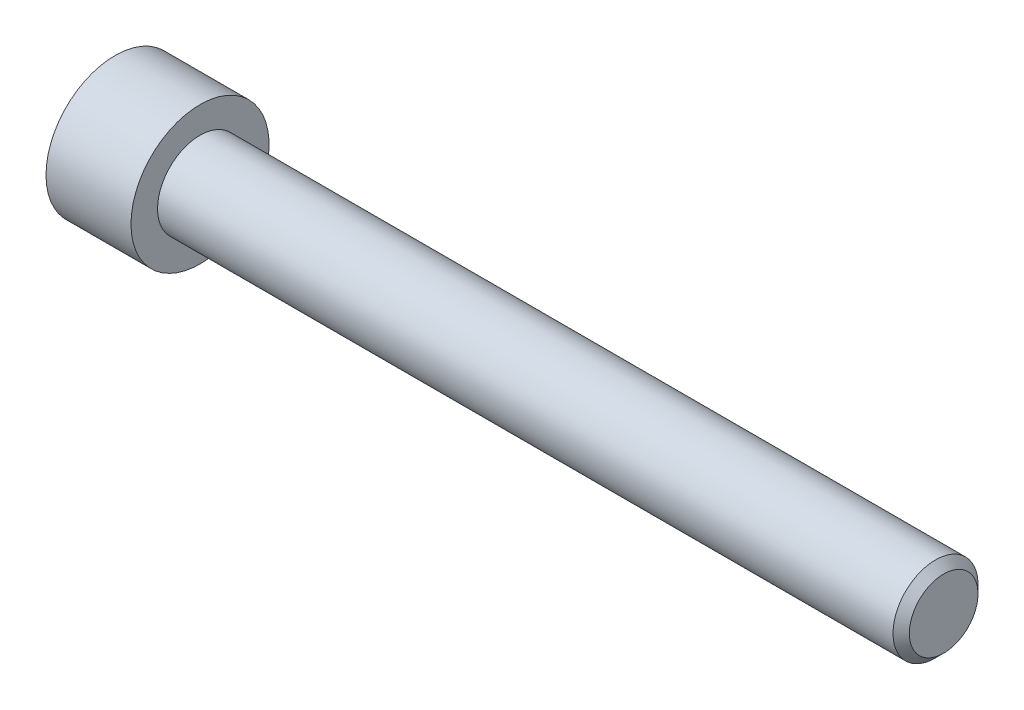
ISO-10303-21;
HEADER;
FILE_DESCRIPTION(('STEP AP214'),'2;1');
FILE_NAME('part.step','',(''),(''),'','','');
FILE_SCHEMA(('AUTOMOTIVE_DESIGN { 1 0 10303 214 1 1 1 1 }'));
ENDSEC;
DATA;
#1=APPLICATION_CONTEXT('core data for automotive mechanical design processes');
#2=APPLICATION_PROTOCOL_DEFINITION('international standard','automotive_design',2000,#1);
#3=PRODUCT_CONTEXT('',#1,'mechanical');
#4=PRODUCT('Part','Part','',(#3));
#5=PRODUCT_RELATED_PRODUCT_CATEGORY('part','',(#4));
#6=PRODUCT_DEFINITION_FORMATION('','',#4);
#7=PRODUCT_DEFINITION_CONTEXT('part definition',#1,'design');
#8=PRODUCT_DEFINITION('design','',#6,#7);
#9=PRODUCT_DEFINITION_SHAPE('','',#8);
#10=(LENGTH_UNIT() NAMED_UNIT(*) SI_UNIT(.MILLI.,.METRE.));
#11=(NAMED_UNIT(*) PLANE_ANGLE_UNIT() SI_UNIT($,.RADIAN.));
#12=(NAMED_UNIT(*) SI_UNIT($,.STERADIAN.) SOLID_ANGLE_UNIT());
#13=UNCERTAINTY_MEASURE_WITH_UNIT(LENGTH_MEASURE(1.E-05),#10,'distance_accuracy_value','');
#14=(GEOMETRIC_REPRESENTATION_CONTEXT(3) GLOBAL_UNCERTAINTY_ASSIGNED_CONTEXT((#13)) GLOBAL_UNIT_ASSIGNED_CONTEXT((#10,
#11,#12)) REPRESENTATION_CONTEXT('',''));
#15=CARTESIAN_POINT('',(0.,0.,0.));
#16=DIRECTION('',(0.,0.,1.));
#17=DIRECTION('',(1.,0.,0.));
#18=AXIS2_PLACEMENT_3D('',#15,#16,#17);
#19=CARTESIAN_POINT('',(-4.,1.73205080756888,3.));
#20=DIRECTION('',(1.,0.,0.));
#21=DIRECTION('',(0.,0.,-1.));
#22=AXIS2_PLACEMENT_3D('',#19,#20,#21);
#23=PLANE('',#22);
#24=DIRECTION('',(0.,-0.5,0.866025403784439));
#25=VECTOR('',#24,1.);
#26=CARTESIAN_POINT('',(-4.,3.46410161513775,0.));
#27=LINE('',#26,#25);
#28=CARTESIAN_POINT('',(-4.,3.46410161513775,0.));
#29=VERTEX_POINT('',#28);
#30=CARTESIAN_POINT('',(-4.,1.73205080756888,3.));
#31=VERTEX_POINT('',#30);
#32=EDGE_CURVE('E182',#29,#31,#27,.T.);
#33=ORIENTED_EDGE('',*,*,#32,.F.);
#34=DIRECTION('',(0.,0.5,0.866025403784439));
#35=VECTOR('',#34,1.);
#36=CARTESIAN_POINT('',(-4.,1.73205080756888,-3.));
#37=LINE('',#36,#35);
#38=CARTESIAN_POINT('',(-4.,1.73205080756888,-3.));
#39=VERTEX_POINT('',#38);
#40=EDGE_CURVE('E54',#39,#29,#37,.T.);
#41=ORIENTED_EDGE('',*,*,#40,.F.);
#42=DIRECTION('',(0.,1.,0.));
#43=VECTOR('',#42,1.);
#44=CARTESIAN_POINT('',(-4.,-1.73205080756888,-3.));
#45=LINE('',#44,#43);
#46=CARTESIAN_POINT('',(-4.,-1.73205080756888,-3.));
#47=VERTEX_POINT('',#46);
#48=EDGE_CURVE('E174',#47,#39,#45,.T.);
#49=ORIENTED_EDGE('',*,*,#48,.F.);
#50=DIRECTION('',(0.,0.5,-0.866025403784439));
#51=VECTOR('',#50,1.);
#52=CARTESIAN_POINT('',(-4.,-3.46410161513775,0.));
#53=LINE('',#52,#51);
#54=CARTESIAN_POINT('',(-4.,-3.46410161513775,0.));
#55=VERTEX_POINT('',#54);
#56=EDGE_CURVE('E176',#55,#47,#53,.T.);
#57=ORIENTED_EDGE('',*,*,#56,.F.);
#58=DIRECTION('',(0.,-0.5,-0.866025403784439));
#59=VECTOR('',#58,1.);
#60=CARTESIAN_POINT('',(-4.,-1.73205080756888,3.));
#61=LINE('',#60,#59);
#62=CARTESIAN_POINT('',(-4.,-1.73205080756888,3.));
#63=VERTEX_POINT('',#62);
#64=EDGE_CURVE('E178',#63,#55,#61,.T.);
#65=ORIENTED_EDGE('',*,*,#64,.F.);
#66=DIRECTION('',(0.,-1.,0.));
#67=VECTOR('',#66,1.);
#68=CARTESIAN_POINT('',(-4.,1.73205080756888,3.));
#69=LINE('',#68,#67);
#70=EDGE_CURVE('E180',#31,#63,#69,.T.);
#71=ORIENTED_EDGE('',*,*,#70,.F.);
#72=EDGE_LOOP('',(#33,#41,#49,#57,#65,#71));
#73=FACE_BOUND('',#72,.T.);
#74=CARTESIAN_POINT('',(-4.,0.,0.));
#75=DIRECTION('',(-1.,0.,0.));
#76=DIRECTION('',(0.,0.,1.));
#77=AXIS2_PLACEMENT_3D('',#74,#75,#76);
#78=CIRCLE('',#77,2.99);
#79=CARTESIAN_POINT('',(-4.,0.,2.99));
#80=VERTEX_POINT('',#79);
#81=EDGE_CURVE('E201',#80,#80,#78,.T.);
#82=ORIENTED_EDGE('',*,*,#81,.F.);
#83=EDGE_LOOP('',(#82));
#84=FACE_BOUND('',#83,.T.);
#85=ADVANCED_FACE('F32',(#73,#84),#23,.F.);
#86=CARTESIAN_POINT('',(-8.,0.,0.));
#87=DIRECTION('',(1.,0.,0.));
#88=DIRECTION('',(0.,0.,-1.));
#89=AXIS2_PLACEMENT_3D('',#86,#87,#88);
#90=PLANE('',#89);
#91=CARTESIAN_POINT('',(-8.00000000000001,0.,0.));
#92=DIRECTION('',(-1.,0.,0.));
#93=DIRECTION('',(0.,0.,1.));
#94=AXIS2_PLACEMENT_3D('',#91,#92,#93);
#95=CIRCLE('',#94,6.5);
#96=CARTESIAN_POINT('',(-8.00000000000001,0.,6.5));
#97=VERTEX_POINT('',#96);
#98=EDGE_CURVE('E11',#97,#97,#95,.T.);
#99=ORIENTED_EDGE('',*,*,#98,.T.);
#100=EDGE_LOOP('',(#99));
#101=FACE_BOUND('',#100,.T.);
#102=DIRECTION('',(0.,-0.5,0.866025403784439));
#103=VECTOR('',#102,1.);
#104=CARTESIAN_POINT('',(-8.,3.46410161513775,0.));
#105=LINE('',#104,#103);
#106=CARTESIAN_POINT('',(-8.,3.46410161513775,0.));
#107=VERTEX_POINT('',#106);
#108=CARTESIAN_POINT('',(-8.,1.73205080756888,3.));
#109=VERTEX_POINT('',#108);
#110=EDGE_CURVE('E47',#107,#109,#105,.T.);
#111=ORIENTED_EDGE('',*,*,#110,.T.);
#112=DIRECTION('',(0.,-1.,0.));
#113=VECTOR('',#112,1.);
#114=CARTESIAN_POINT('',(-8.,1.73205080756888,3.));
#115=LINE('',#114,#113);
#116=CARTESIAN_POINT('',(-8.,-1.73205080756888,3.));
#117=VERTEX_POINT('',#116);
#118=EDGE_CURVE('E197',#109,#117,#115,.T.);
#119=ORIENTED_EDGE('',*,*,#118,.T.);
#120=DIRECTION('',(0.,-0.5,-0.866025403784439));
#121=VECTOR('',#120,1.);
#122=CARTESIAN_POINT('',(-8.,-1.73205080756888,3.));
#123=LINE('',#122,#121);
#124=CARTESIAN_POINT('',(-8.,-3.46410161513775,0.));
#125=VERTEX_POINT('',#124);
#126=EDGE_CURVE('E194',#117,#125,#123,.T.);
#127=ORIENTED_EDGE('',*,*,#126,.T.);
#128=DIRECTION('',(0.,0.5,-0.866025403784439));
#129=VECTOR('',#128,1.);
#130=CARTESIAN_POINT('',(-8.,-3.46410161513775,0.));
#131=LINE('',#130,#129);
#132=CARTESIAN_POINT('',(-8.,-1.73205080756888,-3.));
#133=VERTEX_POINT('',#132);
#134=EDGE_CURVE('E191',#125,#133,#131,.T.);
#135=ORIENTED_EDGE('',*,*,#134,.T.);
#136=DIRECTION('',(0.,1.,0.));
#137=VECTOR('',#136,1.);
#138=CARTESIAN_POINT('',(-8.,-1.73205080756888,-3.));
#139=LINE('',#138,#137);
#140=CARTESIAN_POINT('',(-8.,1.73205080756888,-3.));
#141=VERTEX_POINT('',#140);
#142=EDGE_CURVE('E188',#133,#141,#139,.T.);
#143=ORIENTED_EDGE('',*,*,#142,.T.);
#144=DIRECTION('',(0.,0.5,0.866025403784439));
#145=VECTOR('',#144,1.);
#146=CARTESIAN_POINT('',(-8.,1.73205080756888,-3.));
#147=LINE('',#146,#145);
#148=EDGE_CURVE('E185',#141,#107,#147,.T.);
#149=ORIENTED_EDGE('',*,*,#148,.T.);
#150=EDGE_LOOP('',(#111,#119,#127,#135,#143,#149));
#151=FACE_BOUND('',#150,.T.);
#152=ADVANCED_FACE('F34',(#101,#151),#90,.F.);
#153=CARTESIAN_POINT('',(70.,0.,0.));
#154=DIRECTION('',(-1.,0.,0.));
#155=DIRECTION('',(0.,0.,1.));
#156=AXIS2_PLACEMENT_3D('',#153,#154,#155);
#157=CYLINDRICAL_SURFACE('',#156,6.5);
#158=ORIENTED_EDGE('',*,*,#98,.F.);
#159=EDGE_LOOP('',(#158));
#160=FACE_BOUND('',#159,.T.);
#161=CARTESIAN_POINT('',(0.,0.,0.));
#162=DIRECTION('',(-1.,0.,0.));
#163=DIRECTION('',(0.,0.,1.));
#164=AXIS2_PLACEMENT_3D('',#161,#162,#163);
#165=CIRCLE('',#164,6.5);
#166=CARTESIAN_POINT('',(0.,0.,6.5));
#167=VERTEX_POINT('',#166);
#168=EDGE_CURVE('E40',#167,#167,#165,.T.);
#169=ORIENTED_EDGE('',*,*,#168,.T.);
#170=EDGE_LOOP('',(#169));
#171=FACE_BOUND('',#170,.T.);
#172=ADVANCED_FACE('F105',(#160,#171),#157,.T.);
#173=CARTESIAN_POINT('',(0.,6.5,0.));
#174=DIRECTION('',(-1.,0.,0.));
#175=DIRECTION('',(0.,0.,1.));
#176=AXIS2_PLACEMENT_3D('',#173,#174,#175);
#177=PLANE('',#176);
#178=ORIENTED_EDGE('',*,*,#168,.F.);
#179=EDGE_LOOP('',(#178));
#180=FACE_BOUND('',#179,.T.);
#181=CARTESIAN_POINT('',(0.,0.,0.));
#182=DIRECTION('',(-1.,0.,0.));
#183=DIRECTION('',(0.,0.,1.));
#184=AXIS2_PLACEMENT_3D('',#181,#182,#183);
#185=CIRCLE('',#184,4.);
#186=CARTESIAN_POINT('',(0.,0.,4.));
#187=VERTEX_POINT('',#186);
#188=EDGE_CURVE('E151',#187,#187,#185,.T.);
#189=ORIENTED_EDGE('',*,*,#188,.T.);
#190=EDGE_LOOP('',(#189));
#191=FACE_BOUND('',#190,.T.);
#192=ADVANCED_FACE('F139',(#180,#191),#177,.F.);
#193=CARTESIAN_POINT('',(70.,0.,0.));
#194=DIRECTION('',(-1.,0.,0.));
#195=DIRECTION('',(0.,0.,1.));
#196=AXIS2_PLACEMENT_3D('',#193,#194,#195);
#197=CYLINDRICAL_SURFACE('',#196,4.);
#198=ORIENTED_EDGE('',*,*,#188,.F.);
#199=EDGE_LOOP('',(#198));
#200=FACE_BOUND('',#199,.T.);
#201=CARTESIAN_POINT('',(69.233,0.,0.));
#202=DIRECTION('',(-1.,0.,0.));
#203=DIRECTION('',(0.,0.,1.));
#204=AXIS2_PLACEMENT_3D('',#201,#202,#203);
#205=CIRCLE('',#204,4.);
#206=CARTESIAN_POINT('',(69.233,0.,4.));
#207=VERTEX_POINT('',#206);
#208=EDGE_CURVE('E153',#207,#207,#205,.T.);
#209=ORIENTED_EDGE('',*,*,#208,.T.);
#210=EDGE_LOOP('',(#209));
#211=FACE_BOUND('',#210,.T.);
#212=ADVANCED_FACE('F135',(#200,#211),#197,.T.);
#213=CARTESIAN_POINT('',(70.,0.,0.));
#214=DIRECTION('',(-1.,0.,0.));
#215=DIRECTION('',(0.,0.,1.));
#216=AXIS2_PLACEMENT_3D('',#213,#214,#215);
#217=CONICAL_SURFACE('',#216,3.233,0.785398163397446);
#218=ORIENTED_EDGE('',*,*,#208,.F.);
#219=EDGE_LOOP('',(#218));
#220=FACE_BOUND('',#219,.T.);
#221=CARTESIAN_POINT('',(70.,0.,0.));
#222=DIRECTION('',(-1.,0.,0.));
#223=DIRECTION('',(0.,0.,1.));
#224=AXIS2_PLACEMENT_3D('',#221,#222,#223);
#225=CIRCLE('',#224,3.233);
#226=CARTESIAN_POINT('',(70.,0.,3.233));
#227=VERTEX_POINT('',#226);
#228=EDGE_CURVE('E158',#227,#227,#225,.T.);
#229=ORIENTED_EDGE('',*,*,#228,.T.);
#230=EDGE_LOOP('',(#229));
#231=FACE_BOUND('',#230,.T.);
#232=ADVANCED_FACE('F131',(#220,#231),#217,.T.);
#233=CARTESIAN_POINT('',(70.,3.233,0.));
#234=DIRECTION('',(-1.,0.,0.));
#235=DIRECTION('',(0.,0.,1.));
#236=AXIS2_PLACEMENT_3D('',#233,#234,#235);
#237=PLANE('',#236);
#238=ORIENTED_EDGE('',*,*,#228,.F.);
#239=EDGE_LOOP('',(#238));
#240=FACE_BOUND('',#239,.T.);
#241=ADVANCED_FACE('F128',(#240),#237,.F.);
#242=CARTESIAN_POINT('',(-4.,3.46410161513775,0.));
#243=DIRECTION('',(0.,-0.866025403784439,-0.5));
#244=DIRECTION('',(0.,0.5,-0.866025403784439));
#245=AXIS2_PLACEMENT_3D('',#242,#243,#244);
#246=PLANE('',#245);
#247=ORIENTED_EDGE('',*,*,#110,.F.);
#248=DIRECTION('',(-1.,0.,0.));
#249=VECTOR('',#248,1.);
#250=CARTESIAN_POINT('',(-4.,3.46410161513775,0.));
#251=LINE('',#250,#249);
#252=EDGE_CURVE('E171',#29,#107,#251,.T.);
#253=ORIENTED_EDGE('',*,*,#252,.F.);
#254=ORIENTED_EDGE('',*,*,#32,.T.);
#255=DIRECTION('',(-1.,0.,0.));
#256=VECTOR('',#255,1.);
#257=CARTESIAN_POINT('',(-4.,1.73205080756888,3.));
#258=LINE('',#257,#256);
#259=EDGE_CURVE('E161',#31,#109,#258,.T.);
#260=ORIENTED_EDGE('',*,*,#259,.T.);
#261=EDGE_LOOP('',(#247,#253,#254,#260));
#262=FACE_BOUND('',#261,.T.);
#263=ADVANCED_FACE('F124',(#262),#246,.T.);
#264=CARTESIAN_POINT('',(-4.,1.73205080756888,3.));
#265=DIRECTION('',(0.,0.,-1.));
#266=DIRECTION('',(-1.,0.,0.));
#267=AXIS2_PLACEMENT_3D('',#264,#265,#266);
#268=PLANE('',#267);
#269=ORIENTED_EDGE('',*,*,#118,.F.);
#270=ORIENTED_EDGE('',*,*,#259,.F.);
#271=ORIENTED_EDGE('',*,*,#70,.T.);
#272=DIRECTION('',(-1.,0.,0.));
#273=VECTOR('',#272,1.);
#274=CARTESIAN_POINT('',(-4.,-1.73205080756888,3.));
#275=LINE('',#274,#273);
#276=EDGE_CURVE('E163',#63,#117,#275,.T.);
#277=ORIENTED_EDGE('',*,*,#276,.T.);
#278=EDGE_LOOP('',(#269,#270,#271,#277));
#279=FACE_BOUND('',#278,.T.);
#280=ADVANCED_FACE('F120',(#279),#268,.T.);
#281=CARTESIAN_POINT('',(-4.,-1.73205080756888,3.));
#282=DIRECTION('',(0.,0.866025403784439,-0.5));
#283=DIRECTION('',(0.,0.5,0.866025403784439));
#284=AXIS2_PLACEMENT_3D('',#281,#282,#283);
#285=PLANE('',#284);
#286=ORIENTED_EDGE('',*,*,#126,.F.);
#287=ORIENTED_EDGE('',*,*,#276,.F.);
#288=ORIENTED_EDGE('',*,*,#64,.T.);
#289=DIRECTION('',(-1.,0.,0.));
#290=VECTOR('',#289,1.);
#291=CARTESIAN_POINT('',(-4.,-3.46410161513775,0.));
#292=LINE('',#291,#290);
#293=EDGE_CURVE('E165',#55,#125,#292,.T.);
#294=ORIENTED_EDGE('',*,*,#293,.T.);
#295=EDGE_LOOP('',(#286,#287,#288,#294));
#296=FACE_BOUND('',#295,.T.);
#297=ADVANCED_FACE('F116',(#296),#285,.T.);
#298=CARTESIAN_POINT('',(-4.,-3.46410161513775,0.));
#299=DIRECTION('',(0.,0.866025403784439,0.5));
#300=DIRECTION('',(0.,-0.5,0.866025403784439));
#301=AXIS2_PLACEMENT_3D('',#298,#299,#300);
#302=PLANE('',#301);
#303=ORIENTED_EDGE('',*,*,#134,.F.);
#304=ORIENTED_EDGE('',*,*,#293,.F.);
#305=ORIENTED_EDGE('',*,*,#56,.T.);
#306=DIRECTION('',(-1.,0.,0.));
#307=VECTOR('',#306,1.);
#308=CARTESIAN_POINT('',(-4.,-1.73205080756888,-3.));
#309=LINE('',#308,#307);
#310=EDGE_CURVE('E167',#47,#133,#309,.T.);
#311=ORIENTED_EDGE('',*,*,#310,.T.);
#312=EDGE_LOOP('',(#303,#304,#305,#311));
#313=FACE_BOUND('',#312,.T.);
#314=ADVANCED_FACE('F112',(#313),#302,.T.);
#315=CARTESIAN_POINT('',(-4.,-1.73205080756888,-3.));
#316=DIRECTION('',(0.,0.,1.));
#317=DIRECTION('',(1.,0.,0.));
#318=AXIS2_PLACEMENT_3D('',#315,#316,#317);
#319=PLANE('',#318);
#320=ORIENTED_EDGE('',*,*,#142,.F.);
#321=ORIENTED_EDGE('',*,*,#310,.F.);
#322=ORIENTED_EDGE('',*,*,#48,.T.);
#323=DIRECTION('',(-1.,0.,0.));
#324=VECTOR('',#323,1.);
#325=CARTESIAN_POINT('',(-4.,1.73205080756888,-3.));
#326=LINE('',#325,#324);
#327=EDGE_CURVE('E169',#39,#141,#326,.T.);
#328=ORIENTED_EDGE('',*,*,#327,.T.);
#329=EDGE_LOOP('',(#320,#321,#322,#328));
#330=FACE_BOUND('',#329,.T.);
#331=ADVANCED_FACE('F96',(#330),#319,.T.);
#332=CARTESIAN_POINT('',(-4.,1.73205080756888,-3.));
#333=DIRECTION('',(0.,-0.866025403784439,0.5));
#334=DIRECTION('',(0.,-0.5,-0.866025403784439));
#335=AXIS2_PLACEMENT_3D('',#332,#333,#334);
#336=PLANE('',#335);
#337=ORIENTED_EDGE('',*,*,#148,.F.);
#338=ORIENTED_EDGE('',*,*,#327,.F.);
#339=ORIENTED_EDGE('',*,*,#40,.T.);
#340=ORIENTED_EDGE('',*,*,#252,.T.);
#341=EDGE_LOOP('',(#337,#338,#339,#340));
#342=FACE_BOUND('',#341,.T.);
#343=ADVANCED_FACE('F90',(#342),#336,.T.);
#344=CARTESIAN_POINT('',(-2.27372269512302,0.,0.));
#345=DIRECTION('',(-1.,0.,0.));
#346=DIRECTION('',(0.,0.,1.));
#347=AXIS2_PLACEMENT_3D('',#344,#345,#346);
#348=CONICAL_SURFACE('',#347,0.,1.0471975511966);
#349=ORIENTED_EDGE('',*,*,#81,.T.);
#350=EDGE_LOOP('',(#349));
#351=FACE_BOUND('',#350,.T.);
#352=CARTESIAN_POINT('',(-2.27372269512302,0.,0.));
#353=VERTEX_POINT('',#352);
#354=VERTEX_LOOP('',#353);
#355=FACE_BOUND('',#354,.T.);
#356=ADVANCED_FACE('F88',(#351,#355),#348,.F.);
#357=CLOSED_SHELL('',(#85,#152,#172,#192,#212,#232,#241,#263,#280,#297,#314,#331,#343,#356));
#358=MANIFOLD_SOLID_BREP('B2',#357);
#359=ADVANCED_BREP_SHAPE_REPRESENTATION('',(#18,#358),#14);
#360=SHAPE_DEFINITION_REPRESENTATION(#9,#359);
ENDSEC;
END-ISO-10303-21;
